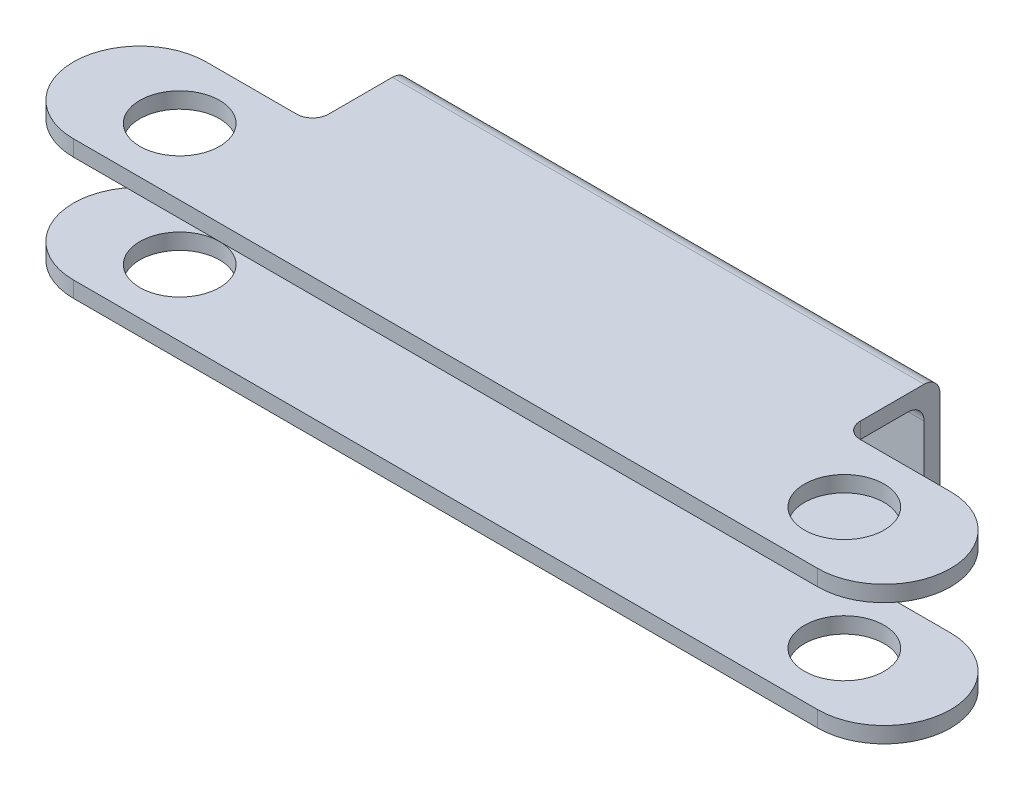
from build123d import *

# Parameters (mm, degrees)
SKIZZE1_R               = 15
LINEAR_AUSTRAGEN1_DEPTH = 6
SKIZZE4_W               = 200
SKIZZE4_H               = 6
LINEAR_AUSTRAGEN2_DEPTH = 55
VERRUNDUNG1_R           = 6
VERRUNDUNG2_R           = 6


with BuildPart() as part:
    # Skizze1 → Linear austragen1 (new body)
    with BuildSketch(Plane(origin=(0, 0, 0), x_dir=(1, 0, 0), z_dir=(0, 1, 0))):
        with BuildLine():
            Line((-140, 25), (-106, 25))
            ThreePointArc((-106, 25), (-101.757359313, 26.757359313), (-100, 31))
            Line((-100, 31), (-100, 55))
            Line((-100, 55), (100, 55))
            Line((100, 55), (100, 31))
            ThreePointArc((100, 31), (101.757359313, 26.757359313), (106, 25))
            Line((106, 25), (140, 25))
            ThreePointArc((140, 25), (165, 0), (140, -25))
            Line((140, -25), (-140, -25))
            ThreePointArc((-140, -25), (-165, 0), (-140, 25))
        make_face()
        with Locations(Location((-125, 0, 0), (0, 0, 270))):
            Circle(SKIZZE1_R, mode=Mode.SUBTRACT)
        with Locations(Location((125, 0, 0), (0, 0, 270))):
            Circle(SKIZZE1_R, mode=Mode.SUBTRACT)
    linear_austragen1 = extrude(amount=LINEAR_AUSTRAGEN1_DEPTH)

    # Skizze4 → Linear austragen2 (add)
    with BuildSketch(Plane(origin=(0, 6, 0), x_dir=(-1, 0, 0), z_dir=(0, 1, 0))):
        with Locations((0, -58)):
            Rectangle(SKIZZE4_W, SKIZZE4_H)
    extrude(amount=-LINEAR_AUSTRAGEN2_DEPTH)

    # Verrundung1
    verrundung1_edges = [part.edges().sort_by_distance(p)[0] for p in [
        (0, 6, -61),
    ]]
    fillet(verrundung1_edges, radius=VERRUNDUNG1_R)

    # Verrundung2
    verrundung2_edges = [part.edges().sort_by_distance(p)[0] for p in [
        (0, 0, -55),
    ]]
    fillet(verrundung2_edges, radius=VERRUNDUNG2_R)

    # Spiegeln4: Linear austragen1 across plane
    add(linear_austragen1.mirror(Plane(origin=(0, -20, 0), x_dir=(0, 0, 1), z_dir=(0, -1, 0))))


solid = part.part
